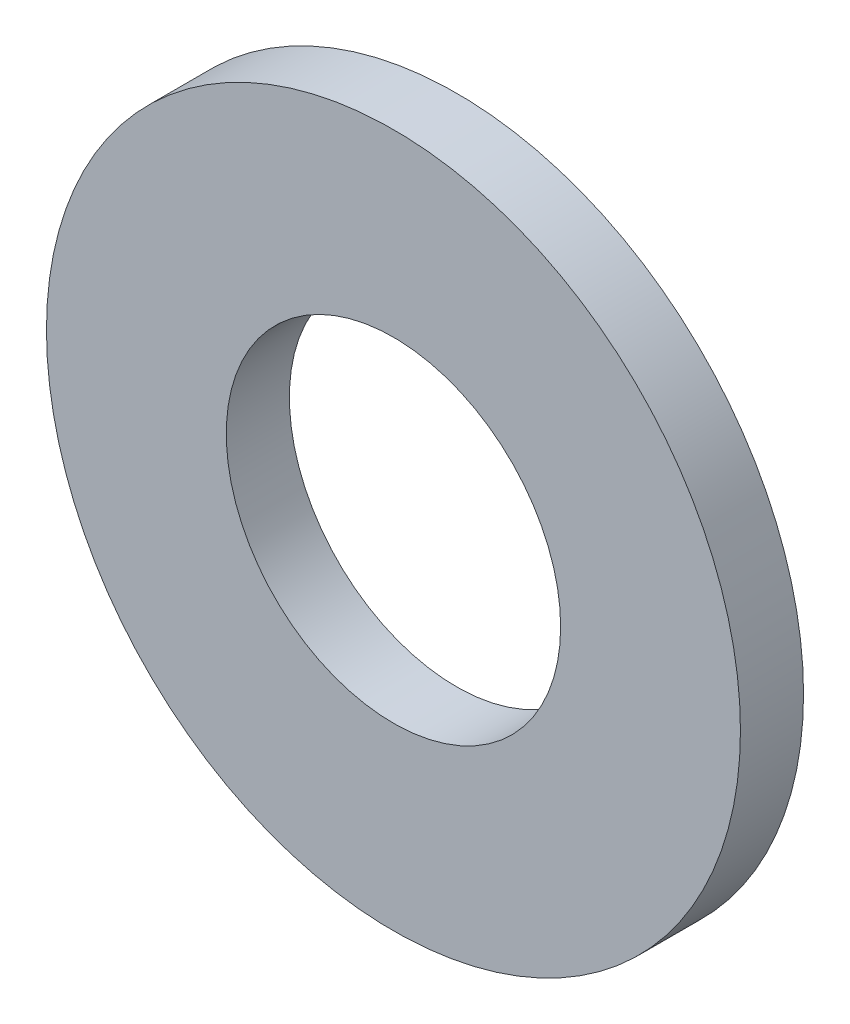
from build123d import *

# Parameters (mm, degrees)
SKETCH3_R           = 5.5
SKETCH3_R_2         = 2.65
BOSS_EXTRUDE1_DEPTH = 1


with BuildPart() as part:
    # Sketch3 → Boss-Extrude1 (new body)
    with BuildSketch(Plane.XY):
        Circle(SKETCH3_R)
        Circle(SKETCH3_R_2, mode=Mode.SUBTRACT)
    extrude(amount=-BOSS_EXTRUDE1_DEPTH)


solid = part.part
